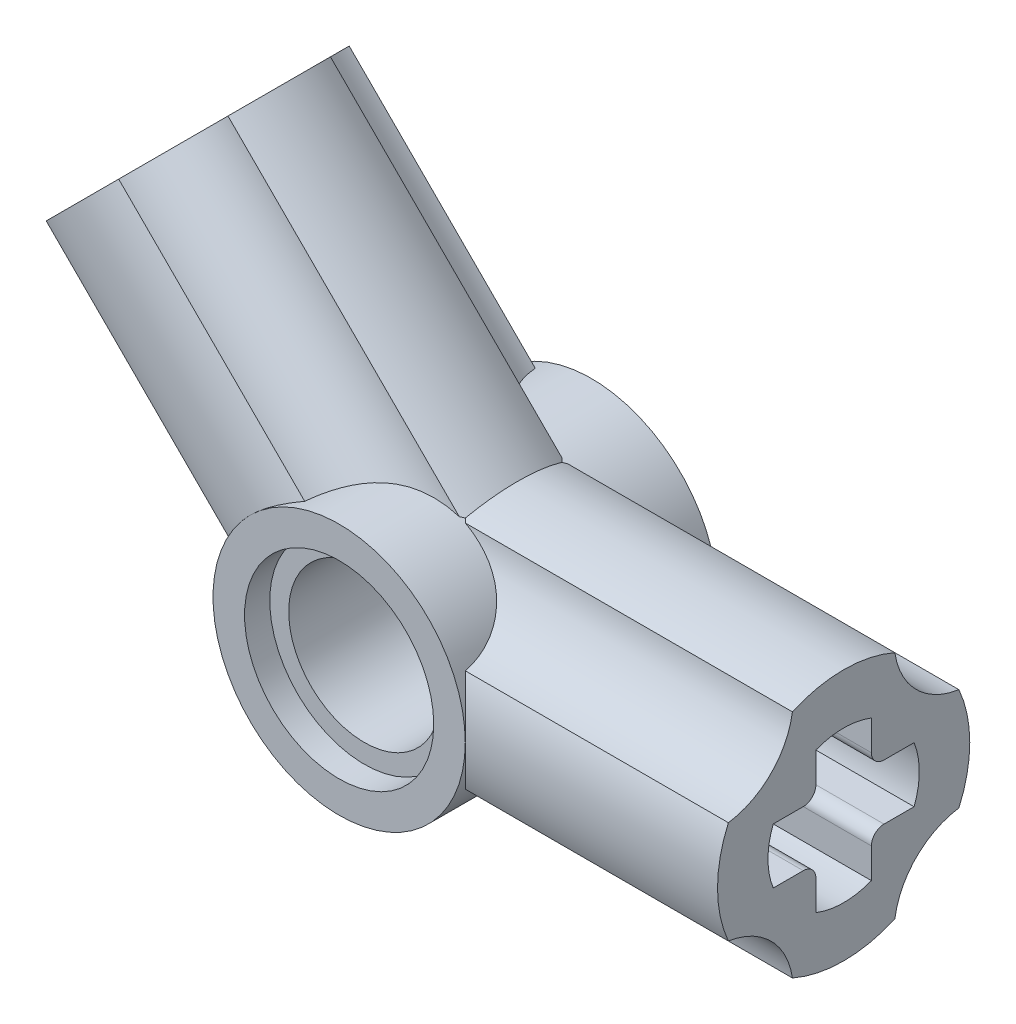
from build123d import *

# Parameters (mm, degrees)
SKETCH_1_W               = 4
SKETCH_1_H               = 8
EXTRUDE_1_REACH          = 18.971
EXTRUDE_1_END_RADIUS     = 4
CUT_EXTRUDE_1_REACH      = 18.971
CUT_EXTRUDE_1_END_RADIUS = 4
FILLET_1_R               = 0.4
PATTERN_CIRCULAR_1_COUNT = 2
PATTERN_CIRCULAR_1_ANGLE = 135


with BuildPart() as part:
    # Sketch 1 → Revolve 1 (revolve)
    with BuildSketch(Plane(origin=(0, 0, 0), x_dir=(1, 0, 0), z_dir=(0, 1, 0))):
        with Locations((-10, 0)):
            Rectangle(SKETCH_1_W, SKETCH_1_H)
    revolve(axis=Axis((-12, 0, -4), (0, 0, 1)))

    # Extrude 1: up to this cylinder (the profile starts outside it)
    extrude_1_end = Plane(origin=(-12, 0, 0), z_dir=(0, 0, 1)) * Cylinder(EXTRUDE_1_END_RADIUS, 46.942, mode=Mode.PRIVATE)
    # Sketch 2 → Extrude 1 (add, up to the surface)
    with BuildSketch(Plane(origin=(0, 0, 0), x_dir=(0, 0, -1), z_dir=(1, 0, 0)), mode=Mode.PRIVATE) as extrude_1_sk1:
        with BuildLine():
            ThreePointArc((-1.624913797, -3.655086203), (0, -4), (1.624913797, -3.655086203))
            ThreePointArc((1.624913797, -3.655086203), (2.302943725, -2.302943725), (3.655086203, -1.624913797))
            ThreePointArc((3.655086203, -1.624913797), (4, 0), (3.655086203, 1.624913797))
            ThreePointArc((3.655086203, 1.624913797), (2.302943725, 2.302943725), (1.624913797, 3.655086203))
            ThreePointArc((1.624913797, 3.655086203), (0, 4), (-1.624913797, 3.655086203))
            ThreePointArc((-1.624913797, 3.655086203), (-2.302943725, 2.302943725), (-3.655086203, 1.624913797))
            ThreePointArc((-3.655086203, 1.624913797), (-4, 0), (-3.655086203, -1.624913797))
            ThreePointArc((-3.655086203, -1.624913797), (-2.302943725, -2.302943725), (-1.624913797, -3.655086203))
        make_face()
    extrude_1_tool1 = extrude(extrude_1_sk1.sketch, amount=-EXTRUDE_1_REACH, mode=Mode.PRIVATE) - extrude_1_end
    extrude_1 = extrude_1_tool1.solids().sort_by_distance((0, 0, 0))[0]
    add(extrude_1)

    # Cut-Extrude 1: up to this cylinder (the profile starts outside it)
    cut_extrude_1_end = Plane(origin=(-12, 0, 0), z_dir=(0, 0, 1)) * Cylinder(CUT_EXTRUDE_1_END_RADIUS, 46.942, mode=Mode.PRIVATE)
    # Sketch 3 → Cut-Extrude 1 (cut, up to the surface)
    with BuildSketch(Plane(origin=(0, 0, 0), x_dir=(0, 0, -1), z_dir=(1, 0, 0)), mode=Mode.PRIVATE) as cut_extrude_1_sk1:
        with BuildLine():
            Line((-0.88, 2.232845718), (-0.88, 0.88))
            Line((-0.88, 0.88), (-2.232845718, 0.88))
            ThreePointArc((-2.232845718, 0.88), (-2.4, 0), (-2.232845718, -0.88))
            Line((-2.232845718, -0.88), (-0.88, -0.88))
            Line((-0.88, -0.88), (-0.88, -2.232845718))
            ThreePointArc((-0.88, -2.232845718), (0, -2.4), (0.88, -2.232845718))
            Line((0.88, -2.232845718), (0.88, -0.88))
            Line((0.88, -0.88), (2.232845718, -0.88))
            ThreePointArc((2.232845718, -0.88), (2.4, 0), (2.232845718, 0.88))
            Line((2.232845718, 0.88), (0.88, 0.88))
            Line((0.88, 0.88), (0.88, 2.232845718))
            ThreePointArc((0.88, 2.232845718), (0, 2.4), (-0.88, 2.232845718))
        make_face()
    cut_extrude_1_tool1 = extrude(cut_extrude_1_sk1.sketch, amount=-CUT_EXTRUDE_1_REACH, mode=Mode.PRIVATE) - cut_extrude_1_end
    cut_extrude_1 = cut_extrude_1_tool1.solids().sort_by_distance((0, 0, 0))[0]
    add(cut_extrude_1, mode=Mode.SUBTRACT)

    # Sketch 4 → Cut-Revolve 1 (revolve, cut)
    with BuildSketch(Plane(origin=(0, 0, 0), x_dir=(1, 0, 0), z_dir=(0, 1, 0))):
        Polygon((-9, 4), (-12, 4), (-12, -4), (-9, -4), (-9, -3.2), (-9.6, -3.2), (-9.6, 3.2), (-9, 3.2), align=None)
    revolve(axis=Axis((-12, 0, -4), (0, 0, 1)), mode=Mode.SUBTRACT)

    # Fillet 1
    fillet_1_edges = [part.edges().sort_by_distance(p)[0] for p in [
        (-4.049000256, 0.88, -0.88),
        (-4.049000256, -0.88, -0.88),
        (-4.049000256, -0.88, 0.88),
        (-4.049000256, 0.88, 0.88),
    ]]
    fillet(fillet_1_edges, radius=FILLET_1_R)

    # Pattern Circular 1: Extrude 1, Cut-Extrude 1 ×2 about axis
    pattern_circular_1_axis = Axis((-12, 0, 0), (0, 0, 1))
    add([extrude_1.rotate(pattern_circular_1_axis, i * PATTERN_CIRCULAR_1_ANGLE / (PATTERN_CIRCULAR_1_COUNT - 1)) for i in range(1, PATTERN_CIRCULAR_1_COUNT)])
    add([cut_extrude_1.rotate(pattern_circular_1_axis, i * PATTERN_CIRCULAR_1_ANGLE / (PATTERN_CIRCULAR_1_COUNT - 1)) for i in range(1, PATTERN_CIRCULAR_1_COUNT)], mode=Mode.SUBTRACT)


solid = part.part
